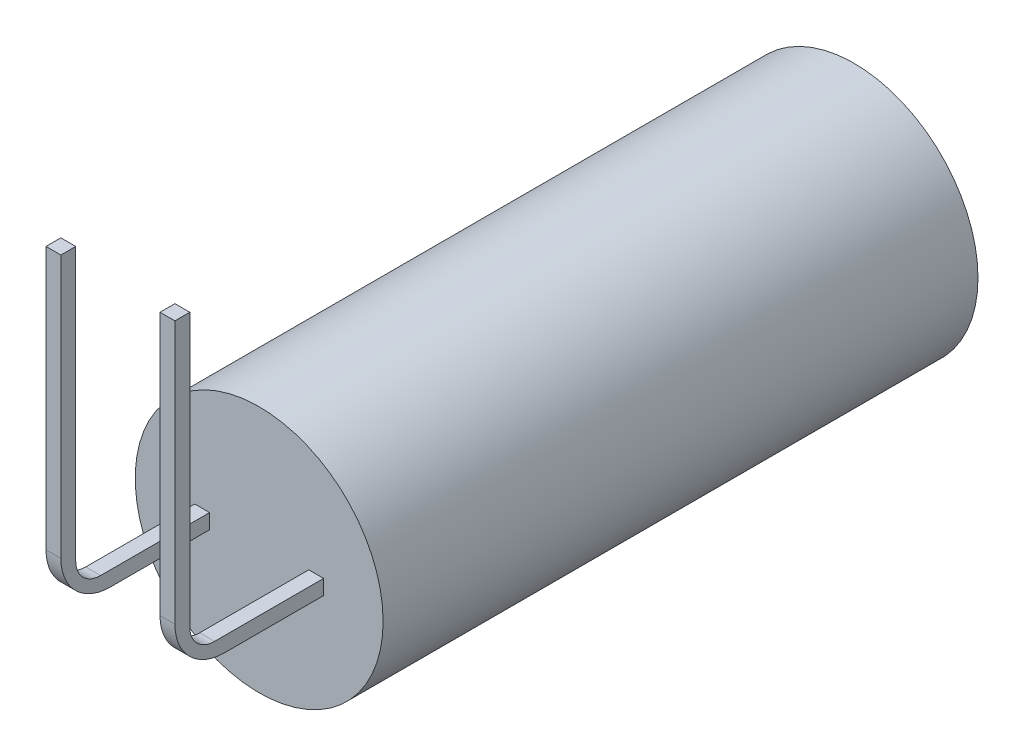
from build123d import *

# Parameters (mm, degrees)
ESQUISSE2_R      = 2.5
EXTRUSION1_DEPTH = 12
ESQUISSE5_W      = 0.3
ESQUISSE5_H      = 0.3
EXTRUSION3_DEPTH = 3
ESQUISSE6_W      = 0.3
ESQUISSE6_H      = 0.3
EXTRUSION4_DEPTH = 6
CONG_1_R         = 0.5
CONG_2_R         = 1


with BuildPart() as part:
    # Esquisse2 → Extrusion1 (new body)
    with BuildSketch(Plane.XY):
        Circle(ESQUISSE2_R)
    extrude(amount=-EXTRUSION1_DEPTH)

    # Esquisse5 → Extrusion3 (add)
    with BuildSketch(Plane.XY):
        with Locations((-1.15, 0)):
            Rectangle(ESQUISSE5_W, ESQUISSE5_H)
        with Locations((1.15, 0)):
            Rectangle(ESQUISSE5_W, ESQUISSE5_H)
    extrude(amount=EXTRUSION3_DEPTH)

    # Esquisse6 → Extrusion4 (add)
    with BuildSketch(Plane(origin=(0, 0.15, 0), x_dir=(-1, 0, 0), z_dir=(0, 1, 0))):
        with Locations((1.15, 2.85)):
            Rectangle(ESQUISSE6_W, ESQUISSE6_H)
        with Locations((-1.15, 2.85)):
            Rectangle(ESQUISSE6_W, ESQUISSE6_H)
    extrude(amount=EXTRUSION4_DEPTH)

    # Cong_1
    cong_1_edges = [part.edges().sort_by_distance(p)[0] for p in [
        (-1.15, 0.15, 2.7),
        (1.15, 0.15, 2.7),
    ]]
    fillet(cong_1_edges, radius=CONG_1_R)

    # Cong_2
    cong_2_edges = [part.edges().sort_by_distance(p)[0] for p in [
        (1.15, -0.15, 3),
        (-1.15, -0.15, 3),
    ]]
    fillet(cong_2_edges, radius=CONG_2_R)


solid = part.part
